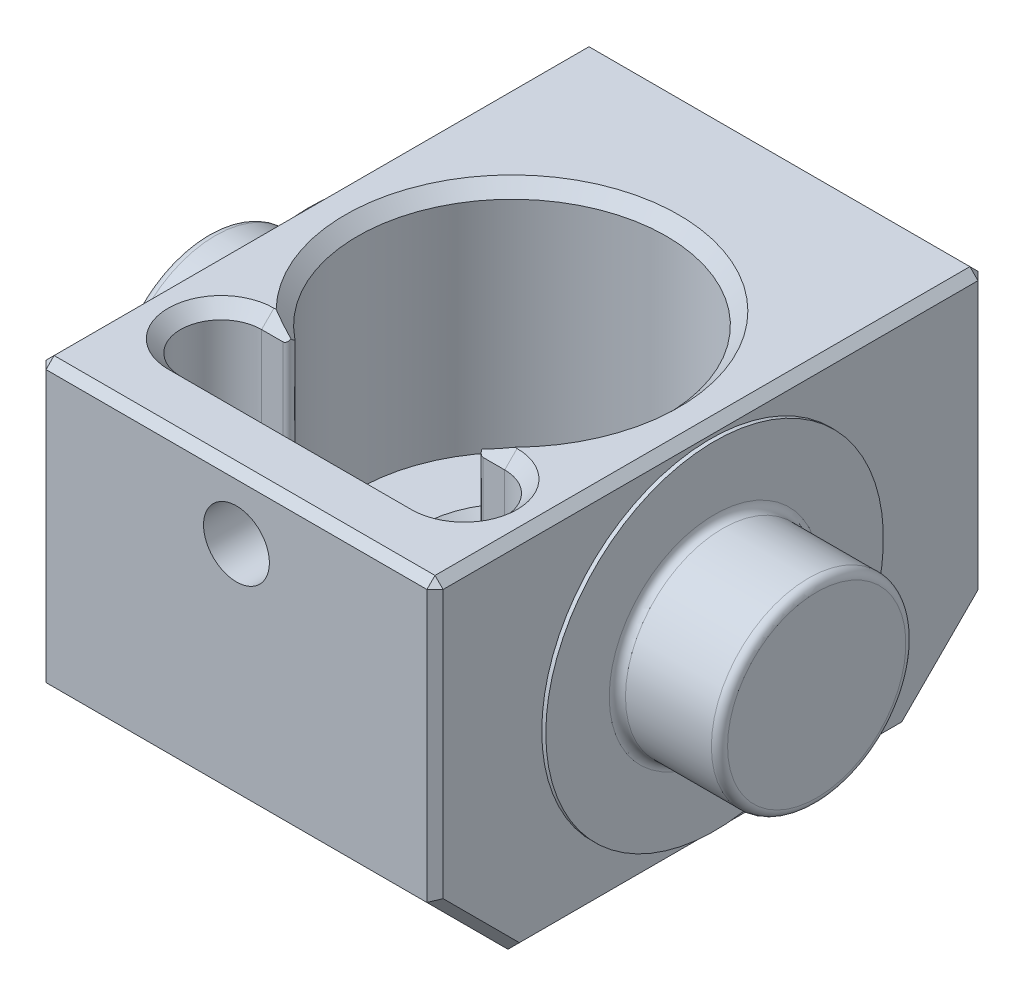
from build123d import *

# Parameters (mm, degrees)
SKETCH1_W           = 34
SKETCH1_H           = 22.225
BOSS_EXTRUDE1_DEPTH = 12.25
SKETCH3_W           = 9.52881
SKETCH3_H           = 14.2875
SKETCH4_W           = 5.1562
SKETCH4_H           = 7.9375
CUT_EXTRUDE1_DEPTH  = 6.5
CHAMFER1_SIZE       = 5
CHAMFER2_SIZE       = 0.5
CHAMFER4_SIZE       = 0.762
FILLET1_R           = 0.3
CHAMFER5_SIZE       = 0.5
FILLET2_R           = 0.500000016
FILLET3_R           = 0.500000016
CUT_EXTRUDE2_REACH  = 42.409
SKETCH9_R           = 2.032


with BuildPart() as part:
    # Sketch1 → Boss-Extrude1 (new, symmetric)
    with BuildSketch(Plane(origin=(0, 0, 0), x_dir=(0, 0, -1), z_dir=(1, 0, 0))):
        Rectangle(SKETCH1_W, SKETCH1_H)
    extrude(amount=BOSS_EXTRUDE1_DEPTH, both=True)

    # Sketch2 → Revolve1 (revolve)
    with BuildSketch(Plane.XY, mode=Mode.PRIVATE) as revolve1_sk:
        Polygon((12.25, 10.414), (12.5, 10.414), (12.5, 6), (18.8, 6), (18.8, 0), (12.25, 0), align=None)
    revolve1 = revolve(revolve1_sk.sketch.rotate(Axis((0, 0, 0), (1, 0, 0)), 90), axis=Axis((0, 0, 0), (1, 0, 0)))

    # Mirror1: Revolve1 across plane
    add(revolve1.mirror(Plane(origin=(0, 0, 0), x_dir=(0, 0, 1), z_dir=(1, 0, 0))))

    # Sketch3 → Cut-Revolve1 (revolve, cut)
    with BuildSketch(Plane.XY, mode=Mode.PRIVATE) as cut_revolve1_sk:
        with Locations((-4.764405, 3.96875)):
            Rectangle(SKETCH3_W, SKETCH3_H)
    revolve(cut_revolve1_sk.sketch.rotate(Axis((0, 10.124682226, 0), (0, -1, 0)), 270), axis=Axis((0, 10.124682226, 0), (0, -1, 0)), mode=Mode.SUBTRACT)

    # Sketch4 → Cut-Revolve2 (revolve, cut)
    with BuildSketch(Plane.XY, mode=Mode.PRIVATE) as cut_revolve2_sk:
        with Locations((-2.5781, -7.14375)):
            Rectangle(SKETCH4_W, SKETCH4_H)
    revolve(cut_revolve2_sk.sketch.rotate(Axis((0, -1.925213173, 0), (0, -1, 0)), 270), axis=Axis((0, -1.925213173, 0), (0, -1, 0)), mode=Mode.SUBTRACT)

    # Sketch5 → Cut-Extrude1 (cut)
    with BuildSketch(Plane(origin=(0, 11.1125, 0), x_dir=(1, 0, 0), z_dir=(0, 1, 0))):
        with BuildLine():
            Line((-7.5, -7.94893), (7.5, -7.94893))
            ThreePointArc((7.5, -7.94893), (10, -10.44893), (7.5, -12.94893))
            Line((7.5, -12.94893), (-7.5, -12.94893))
            ThreePointArc((-7.5, -12.94893), (-10, -10.44893), (-7.5, -7.94893))
        make_face()
    extrude(amount=-CUT_EXTRUDE1_DEPTH, mode=Mode.SUBTRACT)

    # Chamfer1
    chamfer1_edges = [part.edges().sort_by_distance(p)[0] for p in [
        (0, -11.1125, -17),
        (0, -11.1125, 17),
    ]]
    chamfer(chamfer1_edges, length=CHAMFER1_SIZE)

    # Chamfer2
    chamfer2_edges = [part.edges().sort_by_distance(p)[0] for p in [
        (12.25, 2.5, 17),
        (-12.25, 2.5, 17),
        (-12.25, 2.5, -17),
        (12.25, 2.5, -17),
        (-12.25, -11.1125, 0),
        (-12.25, 11.1125, 0),
        (-12.25, -8.6125, 14.5),
        (-12.25, -8.6125, -14.5),
        (12.25, -11.1125, 0),
        (12.25, -8.6125, 14.5),
        (12.25, -8.6125, -14.5),
        (12.25, 11.1125, 0),
        (0, 11.1125, 17),
        (0, 11.1125, -17),
    ]]
    chamfer(chamfer2_edges, length=CHAMFER2_SIZE)

    # Chamfer4
    chamfer4_edges = [part.edges().sort_by_distance(p)[0] for p in [
        (0, 11.1125, -9.52881),
        (6.377390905, 11.1125, 7.94893),
        (-6.377390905, 11.1125, 7.94893),
        (-10, 11.1125, 10.44893),
        (0, 11.1125, 12.94893),
        (10, 11.1125, 10.44893),
    ]]
    chamfer(chamfer4_edges, length=CHAMFER4_SIZE)

    # Fillet1
    fillet1_edges = [part.edges().sort_by_distance(p)[0] for p in [
        (5.25478181, 7.4815, 7.94893),
        (-5.25478181, 7.4815, 7.94893),
    ]]
    fillet(fillet1_edges, radius=FILLET1_R)

    # Chamfer5
    chamfer5_edges = [part.edges().sort_by_distance(p)[0] for p in [
        (0, -11.1125, -5.1562),
        (0, -3.175, -5.1562),
    ]]
    chamfer(chamfer5_edges, length=CHAMFER5_SIZE)

    # Fillet2
    fillet2_edges = [part.edges().sort_by_distance(p)[0] for p in [
        (18.8, 0, -6),
        (-18.8, 0, -6),
    ]]
    fillet(fillet2_edges, radius=FILLET2_R)

    # Fillet3
    fillet3_edges = [part.edges().sort_by_distance(p)[0] for p in [
        (12.5, 0, -6),
        (-12.5, 0, -6),
    ]]
    fillet(fillet3_edges, radius=FILLET3_R)

    # Sketch9 → Cut-Extrude2 (cut, up to next)
    with BuildSketch(Plane.XY.offset(17), mode=Mode.PRIVATE) as cut_extrude2_sk1:
        with Locations((0, 7.1725)):
            Circle(SKETCH9_R)
    cut_extrude2_tool1 = extrude(cut_extrude2_sk1.sketch, amount=-CUT_EXTRUDE2_REACH, mode=Mode.PRIVATE) & part.part
    add(cut_extrude2_tool1.solids().sort_by_distance((0, 7.1725, 17))[0], mode=Mode.SUBTRACT)


solid = part.part
